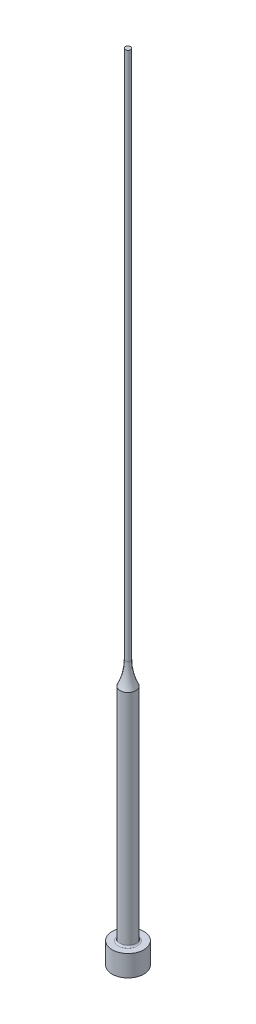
from build123d import *


with BuildPart() as part:
    # Sketch1 → Revolve1 (revolve)
    with BuildSketch(Plane.XY, mode=Mode.PRIVATE) as revolve1_sk:
        with BuildLine():
            Line((0, 0), (3, 0))
            Line((3, 0), (3, 4))
            Line((3, 4), (1.8, 4))
            ThreePointArc((1.8, 4), (1.587867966, 4.087867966), (1.5, 4.3))
            Line((1.5, 4.3), (1.5, 45.641101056))
            ThreePointArc((1.5, 45.641101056), (0.753205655, 47.763932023), (0.5, 50))
            Line((0.5, 50), (0.5, 150))
            Line((0.5, 150), (0, 150))
            Line((0, 150), (0, 0))
        make_face()
    revolve(revolve1_sk.sketch.rotate(Axis((0, 150, 0), (0, -1, 0)), 180), axis=Axis((0, 150, 0), (0, -1, 0)))


solid = part.part
